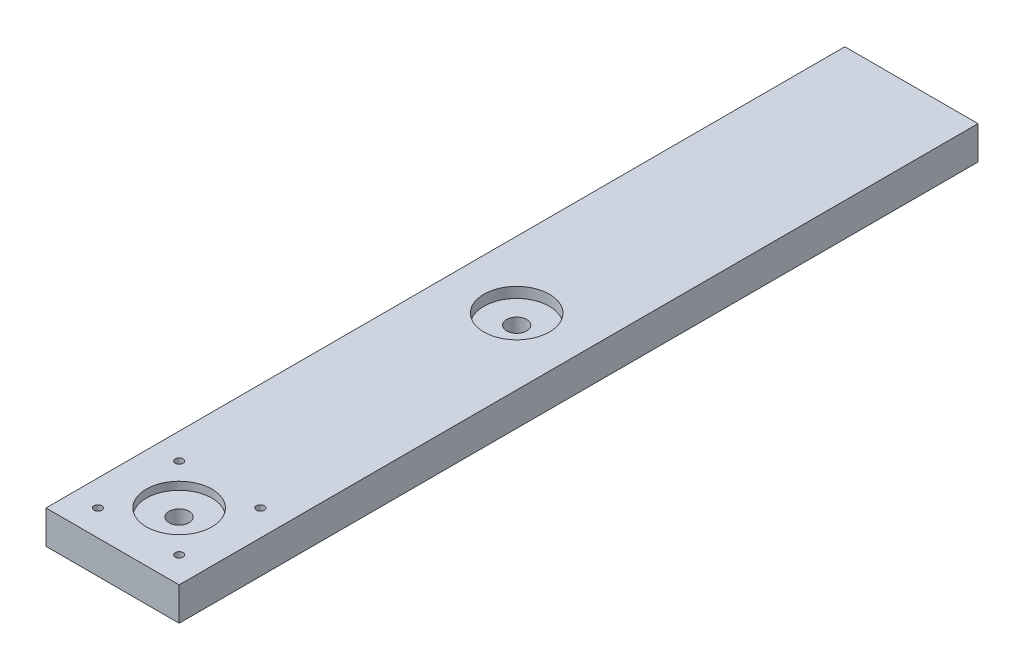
from build123d import *

# Parameters (mm, degrees)
SKETCH2_R           = 5.08
BOSS_EXTRUDE2_DEPTH = 41.91
SKETCH8_W           = 50.8
SKETCH8_H           = 177.8
BOSS_EXTRUDE3_DEPTH = 12.7
SKETCH14_R          = 1.5
SKETCH14_R_2        = 3.81
CUT_EXTRUDE5_DEPTH  = 30.94
SKETCH18_R          = 12.5
CUT_EXTRUDE6_DEPTH  = 3
SKETCH19_W          = 42.604525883
SKETCH19_H          = 46.988260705
CUT_EXTRUDE7_DEPTH  = 85.804
SKETCH20_R          = 3.81
CUT_EXTRUDE8_DEPTH  = 157.771189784
SKETCH21_R          = 12.5
CUT_EXTRUDE9_DEPTH  = 4
SKETCH23_W          = 50.8
SKETCH23_H          = 12.7
BOSS_EXTRUDE4_DEPTH = 127


with BuildPart() as part:
    # Sketch2 → Boss-Extrude2 (new body)
    with BuildSketch(Plane(origin=(0, 0, 0), x_dir=(-1, 0, 0), z_dir=(0, 1, 0))):
        with Locations(Location((0, 0, 0), (0, 0, 90))):
            Circle(SKETCH2_R)
    extrude(amount=BOSS_EXTRUDE2_DEPTH)

    # Sketch8 → Boss-Extrude3 (add)
    with BuildSketch(Plane(origin=(0, 41.91, 0), x_dir=(1, 0, 0), z_dir=(0, 1, 0))):
        with Locations((0, -65.27767655)):
            Rectangle(SKETCH8_W, SKETCH8_H)
    extrude(amount=BOSS_EXTRUDE3_DEPTH)

    # Sketch14 → Cut-Extrude5 (cut)
    with BuildSketch(Plane.XZ.offset(-41.91)):
        with Locations(Location((15.5, 144.27767655, 0), (0, 0, 270))):
            Circle(SKETCH14_R)
        with Locations(Location((0, 128.77767655, 0), (0, 0, 270))):
            Circle(SKETCH14_R_2)
        with Locations(Location((-15.5, 113.27767655, 0), (0, 0, 270))):
            Circle(SKETCH14_R)
        with Locations(Location((15.5, 113.27767655, 0), (0, 0, 270))):
            Circle(SKETCH14_R)
        with Locations(Location((-15.5, 144.27767655, 0), (0, 0, 270))):
            Circle(SKETCH14_R)
    extrude(amount=-CUT_EXTRUDE5_DEPTH, mode=Mode.SUBTRACT)

    # Sketch18 → Cut-Extrude6 (cut)
    with BuildSketch(Plane(origin=(0, 54.61, 0), x_dir=(1, 0, 0), z_dir=(0, 1, 0))):
        with Locations(Location((0, -128.77767655, 0), (0, 0, 270))):
            Circle(SKETCH18_R)
    extrude(amount=-CUT_EXTRUDE6_DEPTH, mode=Mode.SUBTRACT)

    # Sketch19 → Cut-Extrude7 (cut)
    with BuildSketch(Plane.ZY.offset(25.4)):
        with Locations((-1.112784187, 18.415869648)):
            Rectangle(SKETCH19_W, SKETCH19_H)
    extrude(amount=-CUT_EXTRUDE7_DEPTH, mode=Mode.SUBTRACT)

    # Sketch20 → Cut-Extrude8 (cut, through all)
    with BuildSketch(Plane.XZ.offset(-41.91)):
        with Locations(Location((0, 0, 0), (0, 0, 270))):
            Circle(SKETCH20_R)
    extrude(amount=-CUT_EXTRUDE8_DEPTH, mode=Mode.SUBTRACT)

    # Sketch21 → Cut-Extrude9 (cut)
    with BuildSketch(Plane(origin=(0, 54.61, 0), x_dir=(1, 0, 0), z_dir=(0, 1, 0))):
        with Locations(Location((0, 0, 0), (0, 0, 270))):
            Circle(SKETCH21_R)
    extrude(amount=-CUT_EXTRUDE9_DEPTH, mode=Mode.SUBTRACT)

    # Sketch23 → Boss-Extrude4 (add)
    with BuildSketch(Plane(origin=(0, 0, -23.62232345), x_dir=(-1, 0, 0), z_dir=(0, 0, -1))):
        with Locations((0, 48.26)):
            Rectangle(SKETCH23_W, SKETCH23_H)
    extrude(amount=BOSS_EXTRUDE4_DEPTH)


solid = part.part
